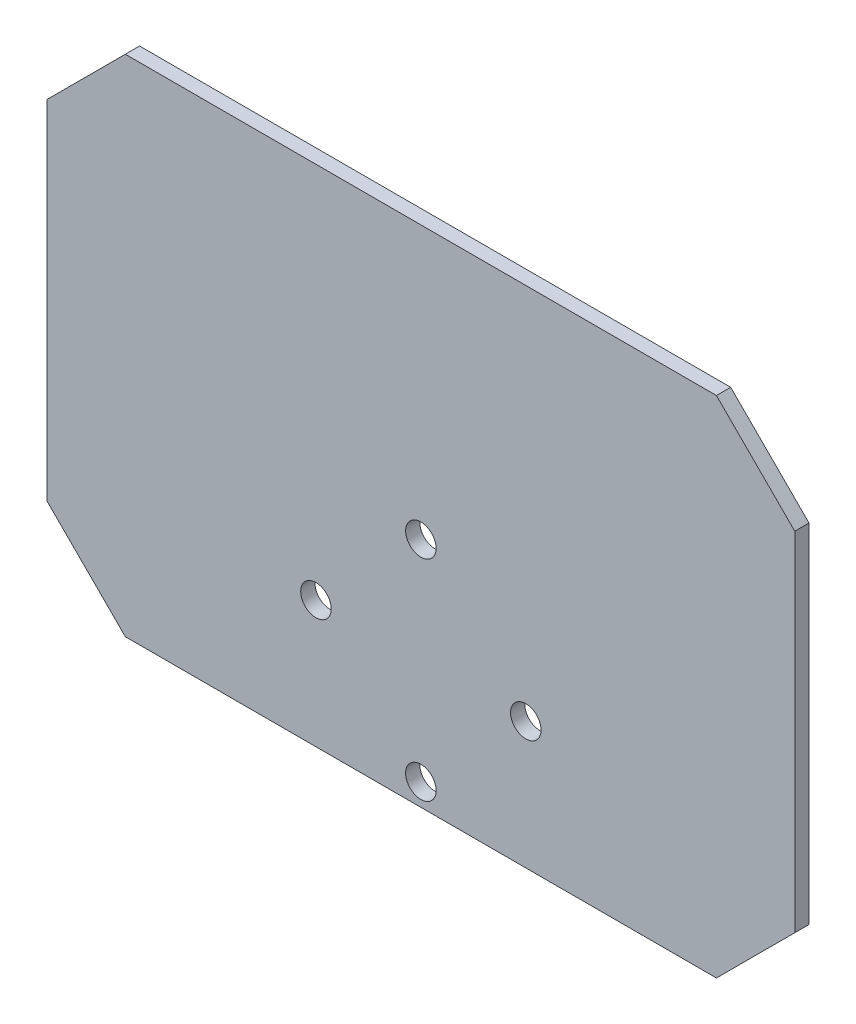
from build123d import *

# Parameters (mm, degrees)
SKETCH1_W                 = 80.01
SKETCH1_H                 = 53.975
BOSS_EXTRUDE1_DEPTH       = 1.524
CHAMFER1_SIZE             = 8.382
F_4_CLEARANCE_HOLE1_D     = 3.2639
F_4_CLEARANCE_HOLE1_DEPTH = 25.4
F_4_CLEARANCE_HOLE1_TIP   = 0.980574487


with BuildPart() as part:
    # Sketch1 → Boss-Extrude1 (new body)
    with BuildSketch(Plane.XY):
        Rectangle(SKETCH1_W, SKETCH1_H)
    extrude(amount=BOSS_EXTRUDE1_DEPTH)

    # Chamfer1
    chamfer1_edges = [part.edges().sort_by_distance(p)[0] for p in [
        (-40.005, 26.9875, 0.762),
        (40.005, 26.9875, 0.762),
        (40.005, -26.9875, 0.762),
        (-40.005, -26.9875, 0.762),
    ]]
    chamfer(chamfer1_edges, length=CHAMFER1_SIZE)

    # 4 Clearance Hole1
    with Locations(Plane(origin=(0, 0, 0), x_dir=(-1, 0, 0), z_dir=(0, 0, -1))):
        with Locations((0, -2.1717), (0, -24.6253), (-11.2268, -13.3985), (11.2268, -13.3985)):
            Hole(F_4_CLEARANCE_HOLE1_D / 2, depth=F_4_CLEARANCE_HOLE1_DEPTH)
            with Locations((0, 0, -(F_4_CLEARANCE_HOLE1_DEPTH + F_4_CLEARANCE_HOLE1_TIP / 2))):  # 118° drill point
                Cone(0, F_4_CLEARANCE_HOLE1_D / 2, F_4_CLEARANCE_HOLE1_TIP, mode=Mode.SUBTRACT)


solid = part.part
